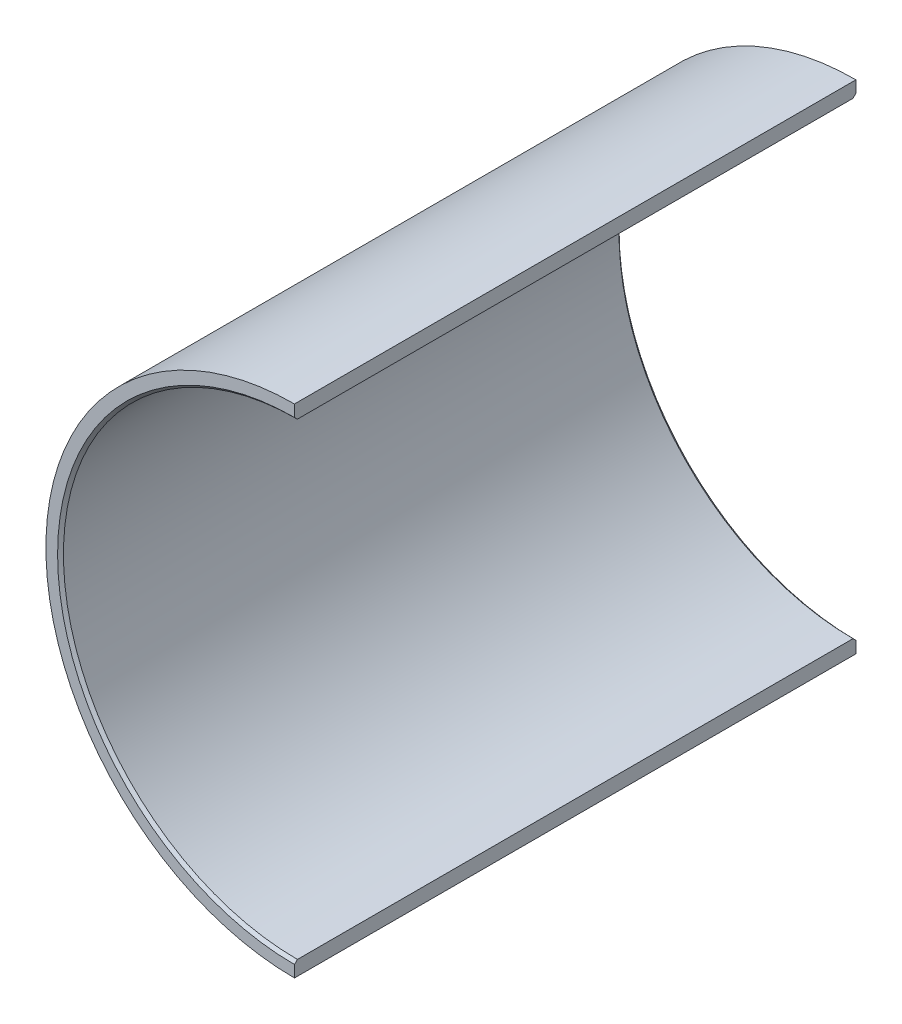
from build123d import *

# Parameters (mm, degrees)
ESQUISSE1_R             = 42.5
ESQUISSE1_R_2           = 40
BASE_EXTRUSION_DEPTH    = 96
CHANFREIN1_SIZE         = 0.5
ESQUISSE2_W             = 160
ESQUISSE2_H             = 150
ENL_V_MAT_EXTRU_1_DEPTH = 79


with BuildPart() as part:
    # Esquisse1 → Base-Extrusion (new body)
    with BuildSketch(Plane.XY):
        Circle(ESQUISSE1_R)
        Circle(ESQUISSE1_R_2, mode=Mode.SUBTRACT)
    extrude(amount=-BASE_EXTRUSION_DEPTH)

    # Chanfrein1
    chanfrein1_edges = [part.edges().sort_by_distance(p)[0] for p in [
        (-40, 0, 0),
        (-40, 0, -96),
    ]]
    chamfer(chanfrein1_edges, length=CHANFREIN1_SIZE)

    # Esquisse2 → Enl_v. mat.-Extru.1 (cut)
    with BuildSketch(Plane(origin=(0, 0, 0), x_dir=(0, 0, -1), z_dir=(1, 0, 0))):
        with Locations((70, 5)):
            Rectangle(ESQUISSE2_W, ESQUISSE2_H)
    extrude(amount=ENL_V_MAT_EXTRU_1_DEPTH, mode=Mode.SUBTRACT)


solid = part.part
